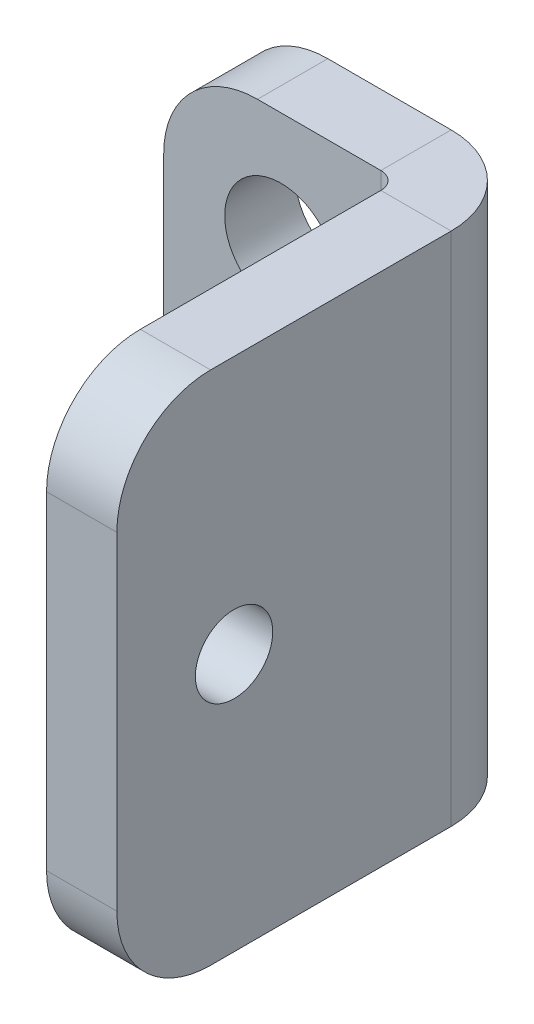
ISO-10303-21;
HEADER;
FILE_DESCRIPTION(('STEP AP214'),'2;1');
FILE_NAME('part.step','',(''),(''),'','','');
FILE_SCHEMA(('AUTOMOTIVE_DESIGN { 1 0 10303 214 1 1 1 1 }'));
ENDSEC;
DATA;
#1=APPLICATION_CONTEXT('core data for automotive mechanical design processes');
#2=APPLICATION_PROTOCOL_DEFINITION('international standard','automotive_design',2000,#1);
#3=PRODUCT_CONTEXT('',#1,'mechanical');
#4=PRODUCT('Part','Part','',(#3));
#5=PRODUCT_RELATED_PRODUCT_CATEGORY('part','',(#4));
#6=PRODUCT_DEFINITION_FORMATION('','',#4);
#7=PRODUCT_DEFINITION_CONTEXT('part definition',#1,'design');
#8=PRODUCT_DEFINITION('design','',#6,#7);
#9=PRODUCT_DEFINITION_SHAPE('','',#8);
#10=(LENGTH_UNIT() NAMED_UNIT(*) SI_UNIT(.MILLI.,.METRE.));
#11=(NAMED_UNIT(*) PLANE_ANGLE_UNIT() SI_UNIT($,.RADIAN.));
#12=(NAMED_UNIT(*) SI_UNIT($,.STERADIAN.) SOLID_ANGLE_UNIT());
#13=UNCERTAINTY_MEASURE_WITH_UNIT(LENGTH_MEASURE(1.E-05),#10,'distance_accuracy_value','');
#14=(GEOMETRIC_REPRESENTATION_CONTEXT(3) GLOBAL_UNCERTAINTY_ASSIGNED_CONTEXT((#13)) GLOBAL_UNIT_ASSIGNED_CONTEXT((#10,
#11,#12)) REPRESENTATION_CONTEXT('',''));
#15=CARTESIAN_POINT('',(0.,0.,0.));
#16=DIRECTION('',(0.,0.,1.));
#17=DIRECTION('',(1.,0.,0.));
#18=AXIS2_PLACEMENT_3D('',#15,#16,#17);
#19=CARTESIAN_POINT('',(0.,22.,-3.));
#20=DIRECTION('',(0.,1.,0.));
#21=DIRECTION('',(0.,0.,1.));
#22=AXIS2_PLACEMENT_3D('',#19,#20,#21);
#23=PLANE('',#22);
#24=DIRECTION('',(-1.,0.,0.));
#25=VECTOR('',#24,1.);
#26=CARTESIAN_POINT('',(0.,22.,-3.));
#27=LINE('',#26,#25);
#28=CARTESIAN_POINT('',(9.2634,22.,-3.));
#29=VERTEX_POINT('',#28);
#30=CARTESIAN_POINT('',(4.,22.,-3.));
#31=VERTEX_POINT('',#30);
#32=EDGE_CURVE('E204',#29,#31,#27,.T.);
#33=ORIENTED_EDGE('',*,*,#32,.T.);
#34=DIRECTION('',(0.,0.,1.));
#35=VECTOR('',#34,1.);
#36=CARTESIAN_POINT('',(4.,22.,-3.));
#37=LINE('',#36,#35);
#38=CARTESIAN_POINT('',(4.,22.,0.));
#39=VERTEX_POINT('',#38);
#40=EDGE_CURVE('E207',#31,#39,#37,.T.);
#41=ORIENTED_EDGE('',*,*,#40,.T.);
#42=DIRECTION('',(-1.,0.,0.));
#43=VECTOR('',#42,1.);
#44=CARTESIAN_POINT('',(0.,22.,0.));
#45=LINE('',#44,#43);
#46=CARTESIAN_POINT('',(9.2634,22.,0.));
#47=VERTEX_POINT('',#46);
#48=EDGE_CURVE('E202',#47,#39,#45,.T.);
#49=ORIENTED_EDGE('',*,*,#48,.F.);
#50=DIRECTION('',(0.,0.,-1.));
#51=VECTOR('',#50,1.);
#52=CARTESIAN_POINT('',(9.2634,22.,0.));
#53=LINE('',#52,#51);
#54=EDGE_CURVE('E185',#47,#29,#53,.T.);
#55=ORIENTED_EDGE('',*,*,#54,.T.);
#56=EDGE_LOOP('',(#33,#41,#49,#55));
#57=FACE_BOUND('',#56,.T.);
#58=ADVANCED_FACE('F50',(#57),#23,.T.);
#59=CARTESIAN_POINT('',(0.,0.,-3.));
#60=DIRECTION('',(0.,0.,-1.));
#61=DIRECTION('',(-1.,0.,0.));
#62=AXIS2_PLACEMENT_3D('',#59,#60,#61);
#63=PLANE('',#62);
#64=CARTESIAN_POINT('',(5.,5.,-3.));
#65=DIRECTION('',(0.,0.,1.));
#66=DIRECTION('',(1.,0.,0.));
#67=AXIS2_PLACEMENT_3D('',#64,#65,#66);
#68=CIRCLE('',#67,2.4);
#69=CARTESIAN_POINT('',(7.4,5.,-3.));
#70=VERTEX_POINT('',#69);
#71=EDGE_CURVE('E269',#70,#70,#68,.T.);
#72=ORIENTED_EDGE('',*,*,#71,.T.);
#73=EDGE_LOOP('',(#72));
#74=FACE_BOUND('',#73,.T.);
#75=CARTESIAN_POINT('',(5.,17.,-3.));
#76=DIRECTION('',(0.,0.,1.));
#77=DIRECTION('',(1.,0.,0.));
#78=AXIS2_PLACEMENT_3D('',#75,#76,#77);
#79=CIRCLE('',#78,2.4);
#80=CARTESIAN_POINT('',(7.4,17.,-3.));
#81=VERTEX_POINT('',#80);
#82=EDGE_CURVE('E262',#81,#81,#79,.T.);
#83=ORIENTED_EDGE('',*,*,#82,.T.);
#84=EDGE_LOOP('',(#83));
#85=FACE_BOUND('',#84,.T.);
#86=DIRECTION('',(0.,-1.,0.));
#87=VECTOR('',#86,1.);
#88=CARTESIAN_POINT('',(0.,0.,-3.));
#89=LINE('',#88,#87);
#90=CARTESIAN_POINT('',(0.,18.,-3.));
#91=VERTEX_POINT('',#90);
#92=CARTESIAN_POINT('',(0.,4.,-3.));
#93=VERTEX_POINT('',#92);
#94=EDGE_CURVE('E198',#91,#93,#89,.T.);
#95=ORIENTED_EDGE('',*,*,#94,.F.);
#96=CARTESIAN_POINT('',(4.,18.,-3.));
#97=DIRECTION('',(0.,0.,-1.));
#98=DIRECTION('',(-1.,0.,0.));
#99=AXIS2_PLACEMENT_3D('',#96,#97,#98);
#100=CIRCLE('',#99,4.);
#101=EDGE_CURVE('E227',#91,#31,#100,.T.);
#102=ORIENTED_EDGE('',*,*,#101,.T.);
#103=ORIENTED_EDGE('',*,*,#32,.F.);
#104=DIRECTION('',(0.,1.,0.));
#105=VECTOR('',#104,1.);
#106=CARTESIAN_POINT('',(9.2634,22.,-3.));
#107=LINE('',#106,#105);
#108=CARTESIAN_POINT('',(9.2634,0.,-3.));
#109=VERTEX_POINT('',#108);
#110=EDGE_CURVE('E149',#29,#109,#107,.F.);
#111=ORIENTED_EDGE('',*,*,#110,.T.);
#112=DIRECTION('',(1.,0.,0.));
#113=VECTOR('',#112,1.);
#114=CARTESIAN_POINT('',(0.,0.,-3.));
#115=LINE('',#114,#113);
#116=CARTESIAN_POINT('',(4.,0.,-3.));
#117=VERTEX_POINT('',#116);
#118=EDGE_CURVE('E201',#117,#109,#115,.T.);
#119=ORIENTED_EDGE('',*,*,#118,.F.);
#120=CARTESIAN_POINT('',(4.,4.,-3.));
#121=DIRECTION('',(0.,0.,-1.));
#122=DIRECTION('',(-1.,0.,0.));
#123=AXIS2_PLACEMENT_3D('',#120,#121,#122);
#124=CIRCLE('',#123,4.);
#125=EDGE_CURVE('E225',#117,#93,#124,.T.);
#126=ORIENTED_EDGE('',*,*,#125,.T.);
#127=EDGE_LOOP('',(#95,#102,#103,#111,#119,#126));
#128=FACE_BOUND('',#127,.T.);
#129=ADVANCED_FACE('F296',(#74,#85,#128),#63,.T.);
#130=CARTESIAN_POINT('',(0.,0.,0.));
#131=DIRECTION('',(0.,0.,-1.));
#132=DIRECTION('',(-1.,0.,0.));
#133=AXIS2_PLACEMENT_3D('',#130,#131,#132);
#134=PLANE('',#133);
#135=CARTESIAN_POINT('',(5.,5.,0.));
#136=DIRECTION('',(0.,0.,1.));
#137=DIRECTION('',(1.,0.,0.));
#138=AXIS2_PLACEMENT_3D('',#135,#136,#137);
#139=CIRCLE('',#138,2.4);
#140=CARTESIAN_POINT('',(7.4,5.,0.));
#141=VERTEX_POINT('',#140);
#142=EDGE_CURVE('E272',#141,#141,#139,.T.);
#143=ORIENTED_EDGE('',*,*,#142,.F.);
#144=EDGE_LOOP('',(#143));
#145=FACE_BOUND('',#144,.T.);
#146=CARTESIAN_POINT('',(5.,17.,0.));
#147=DIRECTION('',(0.,0.,1.));
#148=DIRECTION('',(1.,0.,0.));
#149=AXIS2_PLACEMENT_3D('',#146,#147,#148);
#150=CIRCLE('',#149,2.4);
#151=CARTESIAN_POINT('',(7.4,17.,0.));
#152=VERTEX_POINT('',#151);
#153=EDGE_CURVE('E266',#152,#152,#150,.T.);
#154=ORIENTED_EDGE('',*,*,#153,.F.);
#155=EDGE_LOOP('',(#154));
#156=FACE_BOUND('',#155,.T.);
#157=ORIENTED_EDGE('',*,*,#48,.T.);
#158=CARTESIAN_POINT('',(4.,18.,0.));
#159=DIRECTION('',(0.,0.,-1.));
#160=DIRECTION('',(-1.,0.,0.));
#161=AXIS2_PLACEMENT_3D('',#158,#159,#160);
#162=CIRCLE('',#161,4.);
#163=CARTESIAN_POINT('',(0.,18.,0.));
#164=VERTEX_POINT('',#163);
#165=EDGE_CURVE('E218',#39,#164,#162,.F.);
#166=ORIENTED_EDGE('',*,*,#165,.T.);
#167=DIRECTION('',(0.,-1.,0.));
#168=VECTOR('',#167,1.);
#169=CARTESIAN_POINT('',(0.,0.,0.));
#170=LINE('',#169,#168);
#171=CARTESIAN_POINT('',(0.,4.,0.));
#172=VERTEX_POINT('',#171);
#173=EDGE_CURVE('E196',#164,#172,#170,.T.);
#174=ORIENTED_EDGE('',*,*,#173,.T.);
#175=CARTESIAN_POINT('',(4.,4.,0.));
#176=DIRECTION('',(0.,0.,-1.));
#177=DIRECTION('',(-1.,0.,0.));
#178=AXIS2_PLACEMENT_3D('',#175,#176,#177);
#179=CIRCLE('',#178,4.);
#180=CARTESIAN_POINT('',(4.,0.,0.));
#181=VERTEX_POINT('',#180);
#182=EDGE_CURVE('E216',#172,#181,#179,.F.);
#183=ORIENTED_EDGE('',*,*,#182,.T.);
#184=DIRECTION('',(1.,0.,0.));
#185=VECTOR('',#184,1.);
#186=CARTESIAN_POINT('',(0.,0.,0.));
#187=LINE('',#186,#185);
#188=CARTESIAN_POINT('',(9.2634,0.,0.));
#189=VERTEX_POINT('',#188);
#190=EDGE_CURVE('E210',#181,#189,#187,.T.);
#191=ORIENTED_EDGE('',*,*,#190,.T.);
#192=DIRECTION('',(0.,1.,0.));
#193=VECTOR('',#192,1.);
#194=CARTESIAN_POINT('',(9.2634,22.,0.));
#195=LINE('',#194,#193);
#196=EDGE_CURVE('E189',#47,#189,#195,.F.);
#197=ORIENTED_EDGE('',*,*,#196,.F.);
#198=EDGE_LOOP('',(#157,#166,#174,#183,#191,#197));
#199=FACE_BOUND('',#198,.T.);
#200=ADVANCED_FACE('F302',(#145,#156,#199),#134,.F.);
#201=CARTESIAN_POINT('',(0.,0.,-3.));
#202=DIRECTION('',(-1.,0.,0.));
#203=DIRECTION('',(0.,0.,1.));
#204=AXIS2_PLACEMENT_3D('',#201,#202,#203);
#205=PLANE('',#204);
#206=ORIENTED_EDGE('',*,*,#173,.F.);
#207=DIRECTION('',(0.,0.,1.));
#208=VECTOR('',#207,1.);
#209=CARTESIAN_POINT('',(0.,18.,-3.));
#210=LINE('',#209,#208);
#211=EDGE_CURVE('E223',#164,#91,#210,.F.);
#212=ORIENTED_EDGE('',*,*,#211,.T.);
#213=ORIENTED_EDGE('',*,*,#94,.T.);
#214=DIRECTION('',(0.,0.,1.));
#215=VECTOR('',#214,1.);
#216=CARTESIAN_POINT('',(0.,4.,-3.));
#217=LINE('',#216,#215);
#218=EDGE_CURVE('E220',#93,#172,#217,.T.);
#219=ORIENTED_EDGE('',*,*,#218,.T.);
#220=EDGE_LOOP('',(#206,#212,#213,#219));
#221=FACE_BOUND('',#220,.T.);
#222=ADVANCED_FACE('F311',(#221),#205,.T.);
#223=CARTESIAN_POINT('',(0.,0.,-3.));
#224=DIRECTION('',(0.,-1.,0.));
#225=DIRECTION('',(0.,0.,-1.));
#226=AXIS2_PLACEMENT_3D('',#223,#224,#225);
#227=PLANE('',#226);
#228=ORIENTED_EDGE('',*,*,#190,.F.);
#229=DIRECTION('',(0.,0.,1.));
#230=VECTOR('',#229,1.);
#231=CARTESIAN_POINT('',(4.,0.,-3.));
#232=LINE('',#231,#230);
#233=EDGE_CURVE('E229',#181,#117,#232,.F.);
#234=ORIENTED_EDGE('',*,*,#233,.T.);
#235=ORIENTED_EDGE('',*,*,#118,.T.);
#236=DIRECTION('',(0.,0.,-1.));
#237=VECTOR('',#236,1.);
#238=CARTESIAN_POINT('',(9.2634,0.,0.));
#239=LINE('',#238,#237);
#240=EDGE_CURVE('E193',#189,#109,#239,.T.);
#241=ORIENTED_EDGE('',*,*,#240,.F.);
#242=EDGE_LOOP('',(#228,#234,#235,#241));
#243=FACE_BOUND('',#242,.T.);
#244=ADVANCED_FACE('F307',(#243),#227,.T.);
#245=CARTESIAN_POINT('',(9.2634,0.,0.7366));
#246=DIRECTION('',(0.,-1.,0.));
#247=DIRECTION('',(0.,0.,-1.));
#248=AXIS2_PLACEMENT_3D('',#245,#246,#247);
#249=PLANE('',#248);
#250=DIRECTION('',(1.,0.,0.));
#251=VECTOR('',#250,1.);
#252=CARTESIAN_POINT('',(10.,0.,0.736599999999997));
#253=LINE('',#252,#251);
#254=CARTESIAN_POINT('',(10.,0.,0.736599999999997));
#255=VERTEX_POINT('',#254);
#256=CARTESIAN_POINT('',(13.,0.,0.736599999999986));
#257=VERTEX_POINT('',#256);
#258=EDGE_CURVE('E251',#255,#257,#253,.T.);
#259=ORIENTED_EDGE('',*,*,#258,.F.);
#260=CARTESIAN_POINT('',(9.2634,0.,0.7366));
#261=DIRECTION('',(0.,1.,0.));
#262=DIRECTION('',(0.,0.,1.));
#263=AXIS2_PLACEMENT_3D('',#260,#261,#262);
#264=CIRCLE('',#263,0.7366);
#265=EDGE_CURVE('E152',#189,#255,#264,.F.);
#266=ORIENTED_EDGE('',*,*,#265,.F.);
#267=ORIENTED_EDGE('',*,*,#240,.T.);
#268=CARTESIAN_POINT('',(9.2634,0.,0.7366));
#269=DIRECTION('',(0.,1.,0.));
#270=DIRECTION('',(0.,0.,1.));
#271=AXIS2_PLACEMENT_3D('',#268,#269,#270);
#272=CIRCLE('',#271,3.7366);
#273=EDGE_CURVE('E184',#109,#257,#272,.F.);
#274=ORIENTED_EDGE('',*,*,#273,.T.);
#275=EDGE_LOOP('',(#259,#266,#267,#274));
#276=FACE_BOUND('',#275,.T.);
#277=ADVANCED_FACE('F310',(#276),#249,.T.);
#278=CARTESIAN_POINT('',(9.2634,22.,0.7366));
#279=DIRECTION('',(0.,-1.,0.));
#280=DIRECTION('',(0.,0.,-1.));
#281=AXIS2_PLACEMENT_3D('',#278,#279,#280);
#282=PLANE('',#281);
#283=CARTESIAN_POINT('',(9.2634,22.,0.7366));
#284=DIRECTION('',(0.,1.,0.));
#285=DIRECTION('',(0.,0.,1.));
#286=AXIS2_PLACEMENT_3D('',#283,#284,#285);
#287=CIRCLE('',#286,0.7366);
#288=CARTESIAN_POINT('',(10.,22.,0.736599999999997));
#289=VERTEX_POINT('',#288);
#290=EDGE_CURVE('E159',#289,#47,#287,.T.);
#291=ORIENTED_EDGE('',*,*,#290,.F.);
#292=DIRECTION('',(1.,0.,0.));
#293=VECTOR('',#292,1.);
#294=CARTESIAN_POINT('',(10.,22.,0.736599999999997));
#295=LINE('',#294,#293);
#296=CARTESIAN_POINT('',(13.,22.,0.736599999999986));
#297=VERTEX_POINT('',#296);
#298=EDGE_CURVE('E156',#289,#297,#295,.T.);
#299=ORIENTED_EDGE('',*,*,#298,.T.);
#300=CARTESIAN_POINT('',(9.2634,22.,0.7366));
#301=DIRECTION('',(0.,1.,0.));
#302=DIRECTION('',(0.,0.,1.));
#303=AXIS2_PLACEMENT_3D('',#300,#301,#302);
#304=CIRCLE('',#303,3.7366);
#305=EDGE_CURVE('E141',#297,#29,#304,.T.);
#306=ORIENTED_EDGE('',*,*,#305,.T.);
#307=ORIENTED_EDGE('',*,*,#54,.F.);
#308=EDGE_LOOP('',(#291,#299,#306,#307));
#309=FACE_BOUND('',#308,.T.);
#310=ADVANCED_FACE('F157',(#309),#282,.F.);
#311=CARTESIAN_POINT('',(9.2634,22.,0.7366));
#312=DIRECTION('',(0.,1.,0.));
#313=DIRECTION('',(1.,0.,0.));
#314=AXIS2_PLACEMENT_3D('',#311,#312,#313);
#315=CYLINDRICAL_SURFACE('',#314,3.7366);
#316=ORIENTED_EDGE('',*,*,#110,.F.);
#317=ORIENTED_EDGE('',*,*,#305,.F.);
#318=DIRECTION('',(0.,-1.,0.));
#319=VECTOR('',#318,1.);
#320=CARTESIAN_POINT('',(13.,0.,0.736599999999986));
#321=LINE('',#320,#319);
#322=EDGE_CURVE('E146',#297,#257,#321,.T.);
#323=ORIENTED_EDGE('',*,*,#322,.T.);
#324=ORIENTED_EDGE('',*,*,#273,.F.);
#325=EDGE_LOOP('',(#316,#317,#323,#324));
#326=FACE_BOUND('',#325,.T.);
#327=ADVANCED_FACE('F143',(#326),#315,.T.);
#328=CARTESIAN_POINT('',(9.2634,22.,0.7366));
#329=DIRECTION('',(0.,1.,0.));
#330=DIRECTION('',(1.,0.,0.));
#331=AXIS2_PLACEMENT_3D('',#328,#329,#330);
#332=CYLINDRICAL_SURFACE('',#331,0.7366);
#333=ORIENTED_EDGE('',*,*,#196,.T.);
#334=ORIENTED_EDGE('',*,*,#265,.T.);
#335=DIRECTION('',(0.,1.,0.));
#336=VECTOR('',#335,1.);
#337=CARTESIAN_POINT('',(10.,0.,0.736599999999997));
#338=LINE('',#337,#336);
#339=EDGE_CURVE('E161',#255,#289,#338,.T.);
#340=ORIENTED_EDGE('',*,*,#339,.T.);
#341=ORIENTED_EDGE('',*,*,#290,.T.);
#342=EDGE_LOOP('',(#333,#334,#340,#341));
#343=FACE_BOUND('',#342,.T.);
#344=ADVANCED_FACE('F446',(#343),#332,.F.);
#345=CARTESIAN_POINT('',(13.0000000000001,22.,15.));
#346=DIRECTION('',(0.,-1.,0.));
#347=DIRECTION('',(0.,0.,-1.));
#348=AXIS2_PLACEMENT_3D('',#345,#346,#347);
#349=PLANE('',#348);
#350=DIRECTION('',(0.,0.,1.));
#351=VECTOR('',#350,1.);
#352=CARTESIAN_POINT('',(10.0000000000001,22.,15.));
#353=LINE('',#352,#351);
#354=CARTESIAN_POINT('',(10.,22.,11.));
#355=VERTEX_POINT('',#354);
#356=EDGE_CURVE('E169',#289,#355,#353,.T.);
#357=ORIENTED_EDGE('',*,*,#356,.T.);
#358=DIRECTION('',(-1.,0.,0.));
#359=VECTOR('',#358,1.);
#360=CARTESIAN_POINT('',(13.,22.,11.));
#361=LINE('',#360,#359);
#362=CARTESIAN_POINT('',(13.,22.,11.));
#363=VERTEX_POINT('',#362);
#364=EDGE_CURVE('E13',#355,#363,#361,.F.);
#365=ORIENTED_EDGE('',*,*,#364,.T.);
#366=DIRECTION('',(0.,0.,1.));
#367=VECTOR('',#366,1.);
#368=CARTESIAN_POINT('',(13.0000000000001,22.,15.));
#369=LINE('',#368,#367);
#370=EDGE_CURVE('E165',#297,#363,#369,.T.);
#371=ORIENTED_EDGE('',*,*,#370,.F.);
#372=ORIENTED_EDGE('',*,*,#298,.F.);
#373=EDGE_LOOP('',(#357,#365,#371,#372));
#374=FACE_BOUND('',#373,.T.);
#375=ADVANCED_FACE('F171',(#374),#349,.F.);
#376=CARTESIAN_POINT('',(13.,0.,0.));
#377=DIRECTION('',(0.,1.,0.));
#378=DIRECTION('',(0.,0.,1.));
#379=AXIS2_PLACEMENT_3D('',#376,#377,#378);
#380=PLANE('',#379);
#381=DIRECTION('',(0.,0.,-1.));
#382=VECTOR('',#381,1.);
#383=CARTESIAN_POINT('',(13.,0.,0.));
#384=LINE('',#383,#382);
#385=CARTESIAN_POINT('',(13.,0.,11.));
#386=VERTEX_POINT('',#385);
#387=EDGE_CURVE('E168',#386,#257,#384,.T.);
#388=ORIENTED_EDGE('',*,*,#387,.F.);
#389=DIRECTION('',(-1.,0.,0.));
#390=VECTOR('',#389,1.);
#391=CARTESIAN_POINT('',(13.,0.,11.));
#392=LINE('',#391,#390);
#393=CARTESIAN_POINT('',(10.,0.,11.));
#394=VERTEX_POINT('',#393);
#395=EDGE_CURVE('E231',#386,#394,#392,.T.);
#396=ORIENTED_EDGE('',*,*,#395,.T.);
#397=DIRECTION('',(0.,0.,-1.));
#398=VECTOR('',#397,1.);
#399=CARTESIAN_POINT('',(10.,0.,0.));
#400=LINE('',#399,#398);
#401=EDGE_CURVE('E173',#394,#255,#400,.T.);
#402=ORIENTED_EDGE('',*,*,#401,.T.);
#403=ORIENTED_EDGE('',*,*,#258,.T.);
#404=EDGE_LOOP('',(#388,#396,#402,#403));
#405=FACE_BOUND('',#404,.T.);
#406=ADVANCED_FACE('F248',(#405),#380,.F.);
#407=CARTESIAN_POINT('',(13.,0.,0.));
#408=DIRECTION('',(-1.,0.,0.));
#409=DIRECTION('',(0.,0.,1.));
#410=AXIS2_PLACEMENT_3D('',#407,#408,#409);
#411=PLANE('',#410);
#412=CARTESIAN_POINT('',(13.0000000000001,11.,9.99999999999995));
#413=DIRECTION('',(-1.,0.,0.));
#414=DIRECTION('',(0.,0.,1.));
#415=AXIS2_PLACEMENT_3D('',#412,#413,#414);
#416=CIRCLE('',#415,1.65);
#417=CARTESIAN_POINT('',(13.0000000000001,11.,11.65));
#418=VERTEX_POINT('',#417);
#419=EDGE_CURVE('E275',#418,#418,#416,.T.);
#420=ORIENTED_EDGE('',*,*,#419,.T.);
#421=EDGE_LOOP('',(#420));
#422=FACE_BOUND('',#421,.T.);
#423=DIRECTION('',(0.,-1.,0.));
#424=VECTOR('',#423,1.);
#425=CARTESIAN_POINT('',(13.0000000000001,0.,15.));
#426=LINE('',#425,#424);
#427=CARTESIAN_POINT('',(13.0000000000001,18.,15.));
#428=VERTEX_POINT('',#427);
#429=CARTESIAN_POINT('',(13.0000000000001,4.,15.));
#430=VERTEX_POINT('',#429);
#431=EDGE_CURVE('E172',#428,#430,#426,.T.);
#432=ORIENTED_EDGE('',*,*,#431,.T.);
#433=CARTESIAN_POINT('',(13.,4.,11.));
#434=DIRECTION('',(-1.,0.,0.));
#435=DIRECTION('',(0.,0.,1.));
#436=AXIS2_PLACEMENT_3D('',#433,#434,#435);
#437=CIRCLE('',#436,4.);
#438=EDGE_CURVE('E58',#430,#386,#437,.F.);
#439=ORIENTED_EDGE('',*,*,#438,.T.);
#440=ORIENTED_EDGE('',*,*,#387,.T.);
#441=ORIENTED_EDGE('',*,*,#322,.F.);
#442=ORIENTED_EDGE('',*,*,#370,.T.);
#443=CARTESIAN_POINT('',(13.,18.,11.));
#444=DIRECTION('',(-1.,0.,0.));
#445=DIRECTION('',(0.,0.,1.));
#446=AXIS2_PLACEMENT_3D('',#443,#444,#445);
#447=CIRCLE('',#446,4.);
#448=EDGE_CURVE('E242',#363,#428,#447,.F.);
#449=ORIENTED_EDGE('',*,*,#448,.T.);
#450=EDGE_LOOP('',(#432,#439,#440,#441,#442,#449));
#451=FACE_BOUND('',#450,.T.);
#452=ADVANCED_FACE('F164',(#422,#451),#411,.F.);
#453=CARTESIAN_POINT('',(10.,0.,0.));
#454=DIRECTION('',(-1.,0.,0.));
#455=DIRECTION('',(0.,0.,1.));
#456=AXIS2_PLACEMENT_3D('',#453,#454,#455);
#457=PLANE('',#456);
#458=CARTESIAN_POINT('',(10.,11.,9.99999999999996));
#459=DIRECTION('',(-1.,0.,0.));
#460=DIRECTION('',(0.,0.,1.));
#461=AXIS2_PLACEMENT_3D('',#458,#459,#460);
#462=CIRCLE('',#461,1.65);
#463=CARTESIAN_POINT('',(10.,11.,11.65));
#464=VERTEX_POINT('',#463);
#465=EDGE_CURVE('E278',#464,#464,#462,.T.);
#466=ORIENTED_EDGE('',*,*,#465,.F.);
#467=EDGE_LOOP('',(#466));
#468=FACE_BOUND('',#467,.T.);
#469=ORIENTED_EDGE('',*,*,#401,.F.);
#470=CARTESIAN_POINT('',(10.,4.,11.));
#471=DIRECTION('',(-1.,0.,0.));
#472=DIRECTION('',(0.,0.,1.));
#473=AXIS2_PLACEMENT_3D('',#470,#471,#472);
#474=CIRCLE('',#473,4.);
#475=CARTESIAN_POINT('',(10.0000000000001,4.,15.));
#476=VERTEX_POINT('',#475);
#477=EDGE_CURVE('E236',#394,#476,#474,.T.);
#478=ORIENTED_EDGE('',*,*,#477,.T.);
#479=DIRECTION('',(0.,-1.,0.));
#480=VECTOR('',#479,1.);
#481=CARTESIAN_POINT('',(10.0000000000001,0.,15.));
#482=LINE('',#481,#480);
#483=CARTESIAN_POINT('',(10.0000000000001,18.,15.));
#484=VERTEX_POINT('',#483);
#485=EDGE_CURVE('E176',#484,#476,#482,.T.);
#486=ORIENTED_EDGE('',*,*,#485,.F.);
#487=CARTESIAN_POINT('',(10.,18.,11.));
#488=DIRECTION('',(-1.,0.,0.));
#489=DIRECTION('',(0.,0.,1.));
#490=AXIS2_PLACEMENT_3D('',#487,#488,#489);
#491=CIRCLE('',#490,4.);
#492=EDGE_CURVE('E234',#484,#355,#491,.T.);
#493=ORIENTED_EDGE('',*,*,#492,.T.);
#494=ORIENTED_EDGE('',*,*,#356,.F.);
#495=ORIENTED_EDGE('',*,*,#339,.F.);
#496=EDGE_LOOP('',(#469,#478,#486,#493,#494,#495));
#497=FACE_BOUND('',#496,.T.);
#498=ADVANCED_FACE('F255',(#468,#497),#457,.T.);
#499=CARTESIAN_POINT('',(13.0000000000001,0.,15.));
#500=DIRECTION('',(0.,0.,-1.));
#501=DIRECTION('',(-1.,0.,0.));
#502=AXIS2_PLACEMENT_3D('',#499,#500,#501);
#503=PLANE('',#502);
#504=ORIENTED_EDGE('',*,*,#485,.T.);
#505=DIRECTION('',(-1.,0.,0.));
#506=VECTOR('',#505,1.);
#507=CARTESIAN_POINT('',(13.0000000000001,4.,15.));
#508=LINE('',#507,#506);
#509=EDGE_CURVE('E71',#476,#430,#508,.F.);
#510=ORIENTED_EDGE('',*,*,#509,.T.);
#511=ORIENTED_EDGE('',*,*,#431,.F.);
#512=DIRECTION('',(-1.,0.,0.));
#513=VECTOR('',#512,1.);
#514=CARTESIAN_POINT('',(13.0000000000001,18.,15.));
#515=LINE('',#514,#513);
#516=EDGE_CURVE('E238',#428,#484,#515,.T.);
#517=ORIENTED_EDGE('',*,*,#516,.T.);
#518=EDGE_LOOP('',(#504,#510,#511,#517));
#519=FACE_BOUND('',#518,.T.);
#520=ADVANCED_FACE('F257',(#519),#503,.F.);
#521=CARTESIAN_POINT('',(4.,18.,-3.));
#522=DIRECTION('',(0.,0.,1.));
#523=DIRECTION('',(1.,0.,0.));
#524=AXIS2_PLACEMENT_3D('',#521,#522,#523);
#525=CYLINDRICAL_SURFACE('',#524,4.);
#526=ORIENTED_EDGE('',*,*,#101,.F.);
#527=ORIENTED_EDGE('',*,*,#211,.F.);
#528=ORIENTED_EDGE('',*,*,#165,.F.);
#529=ORIENTED_EDGE('',*,*,#40,.F.);
#530=EDGE_LOOP('',(#526,#527,#528,#529));
#531=FACE_BOUND('',#530,.T.);
#532=ADVANCED_FACE('F290',(#531),#525,.T.);
#533=CARTESIAN_POINT('',(4.,4.,-3.));
#534=DIRECTION('',(0.,0.,1.));
#535=DIRECTION('',(1.,0.,0.));
#536=AXIS2_PLACEMENT_3D('',#533,#534,#535);
#537=CYLINDRICAL_SURFACE('',#536,4.);
#538=ORIENTED_EDGE('',*,*,#125,.F.);
#539=ORIENTED_EDGE('',*,*,#233,.F.);
#540=ORIENTED_EDGE('',*,*,#182,.F.);
#541=ORIENTED_EDGE('',*,*,#218,.F.);
#542=EDGE_LOOP('',(#538,#539,#540,#541));
#543=FACE_BOUND('',#542,.T.);
#544=ADVANCED_FACE('F318',(#543),#537,.T.);
#545=CARTESIAN_POINT('',(13.,4.,11.));
#546=DIRECTION('',(-1.,0.,0.));
#547=DIRECTION('',(0.,0.,1.));
#548=AXIS2_PLACEMENT_3D('',#545,#546,#547);
#549=CYLINDRICAL_SURFACE('',#548,4.);
#550=ORIENTED_EDGE('',*,*,#438,.F.);
#551=ORIENTED_EDGE('',*,*,#509,.F.);
#552=ORIENTED_EDGE('',*,*,#477,.F.);
#553=ORIENTED_EDGE('',*,*,#395,.F.);
#554=EDGE_LOOP('',(#550,#551,#552,#553));
#555=FACE_BOUND('',#554,.T.);
#556=ADVANCED_FACE('F252',(#555),#549,.T.);
#557=CARTESIAN_POINT('',(13.,18.,11.));
#558=DIRECTION('',(-1.,0.,0.));
#559=DIRECTION('',(0.,0.,1.));
#560=AXIS2_PLACEMENT_3D('',#557,#558,#559);
#561=CYLINDRICAL_SURFACE('',#560,4.);
#562=ORIENTED_EDGE('',*,*,#448,.F.);
#563=ORIENTED_EDGE('',*,*,#364,.F.);
#564=ORIENTED_EDGE('',*,*,#492,.F.);
#565=ORIENTED_EDGE('',*,*,#516,.F.);
#566=EDGE_LOOP('',(#562,#563,#564,#565));
#567=FACE_BOUND('',#566,.T.);
#568=ADVANCED_FACE('F52',(#567),#561,.T.);
#569=CARTESIAN_POINT('',(5.,17.,0.));
#570=DIRECTION('',(0.,0.,1.));
#571=DIRECTION('',(1.,0.,0.));
#572=AXIS2_PLACEMENT_3D('',#569,#570,#571);
#573=CYLINDRICAL_SURFACE('',#572,2.4);
#574=ORIENTED_EDGE('',*,*,#82,.F.);
#575=EDGE_LOOP('',(#574));
#576=FACE_BOUND('',#575,.T.);
#577=ORIENTED_EDGE('',*,*,#153,.T.);
#578=EDGE_LOOP('',(#577));
#579=FACE_BOUND('',#578,.T.);
#580=ADVANCED_FACE('F326',(#576,#579),#573,.F.);
#581=CARTESIAN_POINT('',(5.,5.,0.));
#582=DIRECTION('',(0.,0.,1.));
#583=DIRECTION('',(1.,0.,0.));
#584=AXIS2_PLACEMENT_3D('',#581,#582,#583);
#585=CYLINDRICAL_SURFACE('',#584,2.4);
#586=ORIENTED_EDGE('',*,*,#71,.F.);
#587=EDGE_LOOP('',(#586));
#588=FACE_BOUND('',#587,.T.);
#589=ORIENTED_EDGE('',*,*,#142,.T.);
#590=EDGE_LOOP('',(#589));
#591=FACE_BOUND('',#590,.T.);
#592=ADVANCED_FACE('F330',(#588,#591),#585,.F.);
#593=CARTESIAN_POINT('',(10.,11.,9.99999999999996));
#594=DIRECTION('',(-1.,0.,0.));
#595=DIRECTION('',(0.,0.,1.));
#596=AXIS2_PLACEMENT_3D('',#593,#594,#595);
#597=CYLINDRICAL_SURFACE('',#596,1.65);
#598=ORIENTED_EDGE('',*,*,#419,.F.);
#599=EDGE_LOOP('',(#598));
#600=FACE_BOUND('',#599,.T.);
#601=ORIENTED_EDGE('',*,*,#465,.T.);
#602=EDGE_LOOP('',(#601));
#603=FACE_BOUND('',#602,.T.);
#604=ADVANCED_FACE('F282',(#600,#603),#597,.F.);
#605=CLOSED_SHELL('',(#58,#129,#200,#222,#244,#277,#310,#327,#344,#375,#406,#452,#498,#520,#532,
#544,#556,#568,#580,#592,#604));
#606=MANIFOLD_SOLID_BREP('B2',#605);
#607=ADVANCED_BREP_SHAPE_REPRESENTATION('',(#18,#606),#14);
#608=SHAPE_DEFINITION_REPRESENTATION(#9,#607);
ENDSEC;
END-ISO-10303-21;
